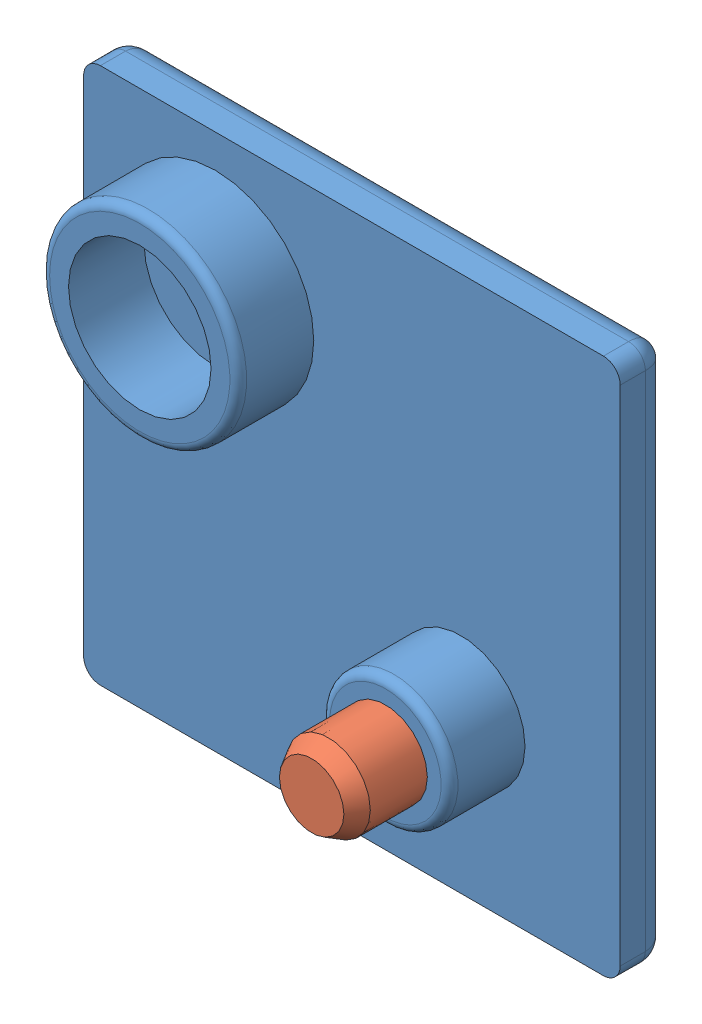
SolidWorks assembly 22.1002_1 END CAP 32X32 GRAY.SLDASM, configuration Default (file format 3800). Lengths in mm.
Overall size (32.01 32.01 11.9).
2 component instances, 2 part files, 2 mates.
Components (placement in the parent):
- 22.1002_1 END CAP 32X32 GRAY-1: 22.1002_1 END CAP 32X32 GRAY.SLDPRT [Default] at origin size (32.01 32.01 7.51)
- END CAP DOWEL GRAY-1: END CAP DOWEL GRAY.SLDPRT [Default] at (-226.2859 -77.9472 13) size (5 5 11.9)
Mates (geometry in assembly coordinates):
- Concentric1: concentric: circle of 22.1002_1 END CAP 32X32 GRAY-1; circle of ?
- Coincident1: coincident aligned: plane of 22.1002_1 END CAP 32X32 GRAY-1 through (-6.5 6.5 0) normal (0 0 -1); plane of ? through (0 0 44.0321) normal (0 0 -1)
